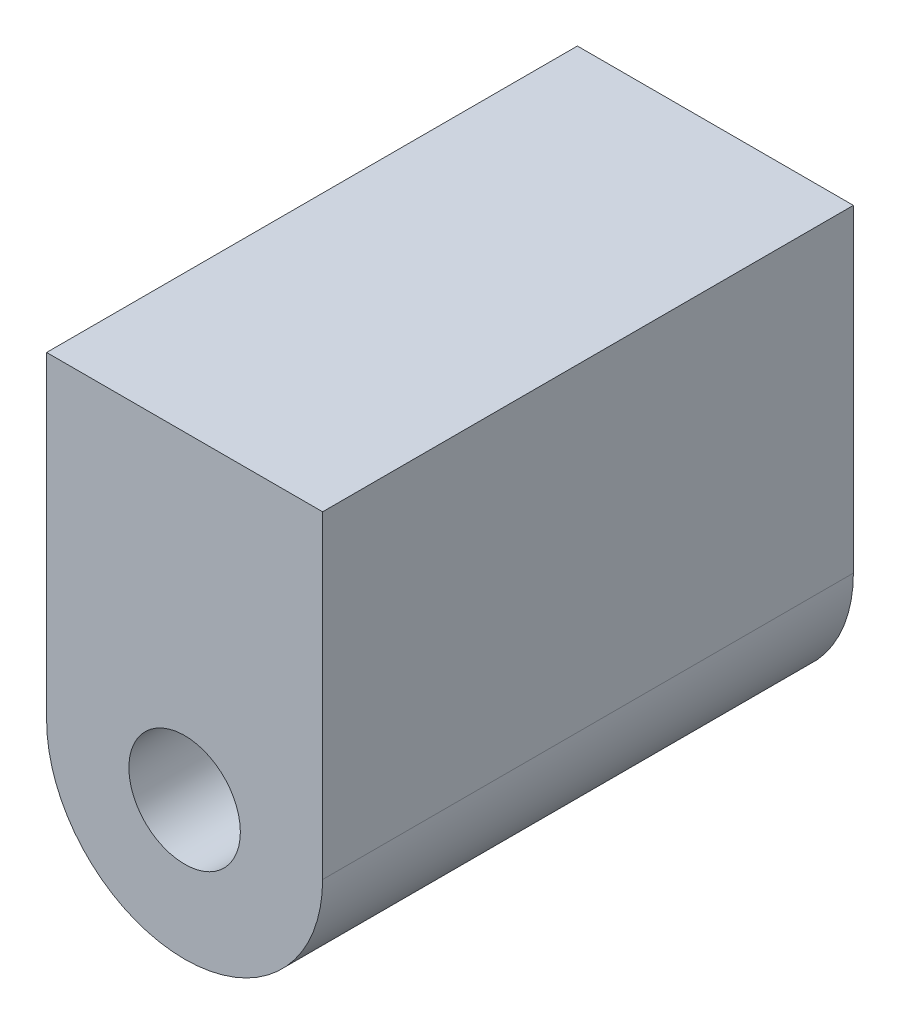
ISO-10303-21;
HEADER;
FILE_DESCRIPTION(('STEP AP214'),'2;1');
FILE_NAME('part.step','',(''),(''),'','','');
FILE_SCHEMA(('AUTOMOTIVE_DESIGN { 1 0 10303 214 1 1 1 1 }'));
ENDSEC;
DATA;
#1=APPLICATION_CONTEXT('core data for automotive mechanical design processes');
#2=APPLICATION_PROTOCOL_DEFINITION('international standard','automotive_design',2000,#1);
#3=PRODUCT_CONTEXT('',#1,'mechanical');
#4=PRODUCT('Part','Part','',(#3));
#5=PRODUCT_RELATED_PRODUCT_CATEGORY('part','',(#4));
#6=PRODUCT_DEFINITION_FORMATION('','',#4);
#7=PRODUCT_DEFINITION_CONTEXT('part definition',#1,'design');
#8=PRODUCT_DEFINITION('design','',#6,#7);
#9=PRODUCT_DEFINITION_SHAPE('','',#8);
#10=(LENGTH_UNIT() NAMED_UNIT(*) SI_UNIT(.MILLI.,.METRE.));
#11=(NAMED_UNIT(*) PLANE_ANGLE_UNIT() SI_UNIT($,.RADIAN.));
#12=(NAMED_UNIT(*) SI_UNIT($,.STERADIAN.) SOLID_ANGLE_UNIT());
#13=UNCERTAINTY_MEASURE_WITH_UNIT(LENGTH_MEASURE(1.E-05),#10,'distance_accuracy_value','');
#14=(GEOMETRIC_REPRESENTATION_CONTEXT(3) GLOBAL_UNCERTAINTY_ASSIGNED_CONTEXT((#13)) GLOBAL_UNIT_ASSIGNED_CONTEXT((#10,
#11,#12)) REPRESENTATION_CONTEXT('',''));
#15=CARTESIAN_POINT('',(0.,0.,0.));
#16=DIRECTION('',(0.,0.,1.));
#17=DIRECTION('',(1.,0.,0.));
#18=AXIS2_PLACEMENT_3D('',#15,#16,#17);
#19=CARTESIAN_POINT('',(0.,0.,50.));
#20=DIRECTION('',(0.,0.,1.));
#21=DIRECTION('',(1.,0.,0.));
#22=AXIS2_PLACEMENT_3D('',#19,#20,#21);
#23=PLANE('',#22);
#24=CARTESIAN_POINT('',(0.,0.,50.));
#25=DIRECTION('',(0.,0.,1.));
#26=DIRECTION('',(1.,0.,0.));
#27=AXIS2_PLACEMENT_3D('',#24,#25,#26);
#28=CIRCLE('',#27,13.);
#29=CARTESIAN_POINT('',(-13.,0.,50.));
#30=VERTEX_POINT('',#29);
#31=CARTESIAN_POINT('',(13.,0.,50.));
#32=VERTEX_POINT('',#31);
#33=EDGE_CURVE('E85',#30,#32,#28,.T.);
#34=ORIENTED_EDGE('',*,*,#33,.T.);
#35=DIRECTION('',(0.,1.,0.));
#36=VECTOR('',#35,1.);
#37=CARTESIAN_POINT('',(13.,0.,50.));
#38=LINE('',#37,#36);
#39=CARTESIAN_POINT('',(13.,30.,50.));
#40=VERTEX_POINT('',#39);
#41=EDGE_CURVE('E80',#32,#40,#38,.T.);
#42=ORIENTED_EDGE('',*,*,#41,.T.);
#43=DIRECTION('',(-1.,0.,0.));
#44=VECTOR('',#43,1.);
#45=CARTESIAN_POINT('',(-13.,30.,50.));
#46=LINE('',#45,#44);
#47=CARTESIAN_POINT('',(-13.,30.,50.));
#48=VERTEX_POINT('',#47);
#49=EDGE_CURVE('E83',#40,#48,#46,.T.);
#50=ORIENTED_EDGE('',*,*,#49,.T.);
#51=DIRECTION('',(0.,-1.,0.));
#52=VECTOR('',#51,1.);
#53=CARTESIAN_POINT('',(-13.,0.,50.));
#54=LINE('',#53,#52);
#55=EDGE_CURVE('E50',#48,#30,#54,.T.);
#56=ORIENTED_EDGE('',*,*,#55,.T.);
#57=EDGE_LOOP('',(#34,#42,#50,#56));
#58=FACE_BOUND('',#57,.T.);
#59=CARTESIAN_POINT('',(0.,0.,50.));
#60=DIRECTION('',(0.,0.,1.));
#61=DIRECTION('',(1.,0.,0.));
#62=AXIS2_PLACEMENT_3D('',#59,#60,#61);
#63=CIRCLE('',#62,5.25);
#64=CARTESIAN_POINT('',(5.25,0.,50.));
#65=VERTEX_POINT('',#64);
#66=EDGE_CURVE('E100',#65,#65,#63,.T.);
#67=ORIENTED_EDGE('',*,*,#66,.F.);
#68=EDGE_LOOP('',(#67));
#69=FACE_BOUND('',#68,.T.);
#70=ADVANCED_FACE('F33',(#58,#69),#23,.T.);
#71=CARTESIAN_POINT('',(0.,0.,0.));
#72=DIRECTION('',(0.,0.,1.));
#73=DIRECTION('',(1.,0.,0.));
#74=AXIS2_PLACEMENT_3D('',#71,#72,#73);
#75=PLANE('',#74);
#76=CARTESIAN_POINT('',(0.,0.,0.));
#77=DIRECTION('',(0.,0.,1.));
#78=DIRECTION('',(1.,0.,0.));
#79=AXIS2_PLACEMENT_3D('',#76,#77,#78);
#80=CIRCLE('',#79,13.);
#81=CARTESIAN_POINT('',(-13.,0.,0.));
#82=VERTEX_POINT('',#81);
#83=CARTESIAN_POINT('',(13.,0.,0.));
#84=VERTEX_POINT('',#83);
#85=EDGE_CURVE('E97',#82,#84,#80,.T.);
#86=ORIENTED_EDGE('',*,*,#85,.F.);
#87=DIRECTION('',(0.,-1.,0.));
#88=VECTOR('',#87,1.);
#89=CARTESIAN_POINT('',(-13.,0.,0.));
#90=LINE('',#89,#88);
#91=CARTESIAN_POINT('',(-13.,30.,0.));
#92=VERTEX_POINT('',#91);
#93=EDGE_CURVE('E73',#92,#82,#90,.T.);
#94=ORIENTED_EDGE('',*,*,#93,.F.);
#95=DIRECTION('',(-1.,0.,0.));
#96=VECTOR('',#95,1.);
#97=CARTESIAN_POINT('',(-13.,30.,0.));
#98=LINE('',#97,#96);
#99=CARTESIAN_POINT('',(13.,30.,0.));
#100=VERTEX_POINT('',#99);
#101=EDGE_CURVE('E67',#100,#92,#98,.T.);
#102=ORIENTED_EDGE('',*,*,#101,.F.);
#103=DIRECTION('',(0.,1.,0.));
#104=VECTOR('',#103,1.);
#105=CARTESIAN_POINT('',(13.,0.,0.));
#106=LINE('',#105,#104);
#107=EDGE_CURVE('E89',#84,#100,#106,.T.);
#108=ORIENTED_EDGE('',*,*,#107,.F.);
#109=EDGE_LOOP('',(#86,#94,#102,#108));
#110=FACE_BOUND('',#109,.T.);
#111=CARTESIAN_POINT('',(0.,0.,0.));
#112=DIRECTION('',(0.,0.,1.));
#113=DIRECTION('',(1.,0.,0.));
#114=AXIS2_PLACEMENT_3D('',#111,#112,#113);
#115=CIRCLE('',#114,5.25);
#116=CARTESIAN_POINT('',(5.25,0.,0.));
#117=VERTEX_POINT('',#116);
#118=EDGE_CURVE('E112',#117,#117,#115,.T.);
#119=ORIENTED_EDGE('',*,*,#118,.T.);
#120=EDGE_LOOP('',(#119));
#121=FACE_BOUND('',#120,.T.);
#122=ADVANCED_FACE('F108',(#110,#121),#75,.F.);
#123=CARTESIAN_POINT('',(0.,0.,50.));
#124=DIRECTION('',(0.,0.,-1.));
#125=DIRECTION('',(-1.,0.,0.));
#126=AXIS2_PLACEMENT_3D('',#123,#124,#125);
#127=CYLINDRICAL_SURFACE('',#126,13.);
#128=ORIENTED_EDGE('',*,*,#85,.T.);
#129=DIRECTION('',(0.,0.,-1.));
#130=VECTOR('',#129,1.);
#131=CARTESIAN_POINT('',(13.,0.,50.));
#132=LINE('',#131,#130);
#133=EDGE_CURVE('E11',#32,#84,#132,.T.);
#134=ORIENTED_EDGE('',*,*,#133,.F.);
#135=ORIENTED_EDGE('',*,*,#33,.F.);
#136=DIRECTION('',(0.,0.,-1.));
#137=VECTOR('',#136,1.);
#138=CARTESIAN_POINT('',(-13.,0.,50.));
#139=LINE('',#138,#137);
#140=EDGE_CURVE('E93',#30,#82,#139,.T.);
#141=ORIENTED_EDGE('',*,*,#140,.T.);
#142=EDGE_LOOP('',(#128,#134,#135,#141));
#143=FACE_BOUND('',#142,.T.);
#144=ADVANCED_FACE('F35',(#143),#127,.T.);
#145=CARTESIAN_POINT('',(13.,0.,50.));
#146=DIRECTION('',(-1.,0.,0.));
#147=DIRECTION('',(0.,0.,1.));
#148=AXIS2_PLACEMENT_3D('',#145,#146,#147);
#149=PLANE('',#148);
#150=ORIENTED_EDGE('',*,*,#107,.T.);
#151=DIRECTION('',(0.,0.,-1.));
#152=VECTOR('',#151,1.);
#153=CARTESIAN_POINT('',(13.,30.,50.));
#154=LINE('',#153,#152);
#155=EDGE_CURVE('E42',#40,#100,#154,.T.);
#156=ORIENTED_EDGE('',*,*,#155,.F.);
#157=ORIENTED_EDGE('',*,*,#41,.F.);
#158=ORIENTED_EDGE('',*,*,#133,.T.);
#159=EDGE_LOOP('',(#150,#156,#157,#158));
#160=FACE_BOUND('',#159,.T.);
#161=ADVANCED_FACE('F88',(#160),#149,.F.);
#162=CARTESIAN_POINT('',(-13.,30.,50.));
#163=DIRECTION('',(0.,-1.,0.));
#164=DIRECTION('',(0.,0.,-1.));
#165=AXIS2_PLACEMENT_3D('',#162,#163,#164);
#166=PLANE('',#165);
#167=ORIENTED_EDGE('',*,*,#101,.T.);
#168=DIRECTION('',(0.,0.,-1.));
#169=VECTOR('',#168,1.);
#170=CARTESIAN_POINT('',(-13.,30.,50.));
#171=LINE('',#170,#169);
#172=EDGE_CURVE('E90',#48,#92,#171,.T.);
#173=ORIENTED_EDGE('',*,*,#172,.F.);
#174=ORIENTED_EDGE('',*,*,#49,.F.);
#175=ORIENTED_EDGE('',*,*,#155,.T.);
#176=EDGE_LOOP('',(#167,#173,#174,#175));
#177=FACE_BOUND('',#176,.T.);
#178=ADVANCED_FACE('F91',(#177),#166,.F.);
#179=CARTESIAN_POINT('',(-13.,0.,50.));
#180=DIRECTION('',(1.,0.,0.));
#181=DIRECTION('',(0.,0.,-1.));
#182=AXIS2_PLACEMENT_3D('',#179,#180,#181);
#183=PLANE('',#182);
#184=ORIENTED_EDGE('',*,*,#93,.T.);
#185=ORIENTED_EDGE('',*,*,#140,.F.);
#186=ORIENTED_EDGE('',*,*,#55,.F.);
#187=ORIENTED_EDGE('',*,*,#172,.T.);
#188=EDGE_LOOP('',(#184,#185,#186,#187));
#189=FACE_BOUND('',#188,.T.);
#190=ADVANCED_FACE('F105',(#189),#183,.F.);
#191=CARTESIAN_POINT('',(0.,0.,50.));
#192=DIRECTION('',(0.,0.,-1.));
#193=DIRECTION('',(-1.,0.,0.));
#194=AXIS2_PLACEMENT_3D('',#191,#192,#193);
#195=CYLINDRICAL_SURFACE('',#194,5.25);
#196=ORIENTED_EDGE('',*,*,#66,.T.);
#197=EDGE_LOOP('',(#196));
#198=FACE_BOUND('',#197,.T.);
#199=ORIENTED_EDGE('',*,*,#118,.F.);
#200=EDGE_LOOP('',(#199));
#201=FACE_BOUND('',#200,.T.);
#202=ADVANCED_FACE('F118',(#198,#201),#195,.F.);
#203=CLOSED_SHELL('',(#70,#122,#144,#161,#178,#190,#202));
#204=MANIFOLD_SOLID_BREP('B2',#203);
#205=ADVANCED_BREP_SHAPE_REPRESENTATION('',(#18,#204),#14);
#206=SHAPE_DEFINITION_REPRESENTATION(#9,#205);
ENDSEC;
END-ISO-10303-21;
